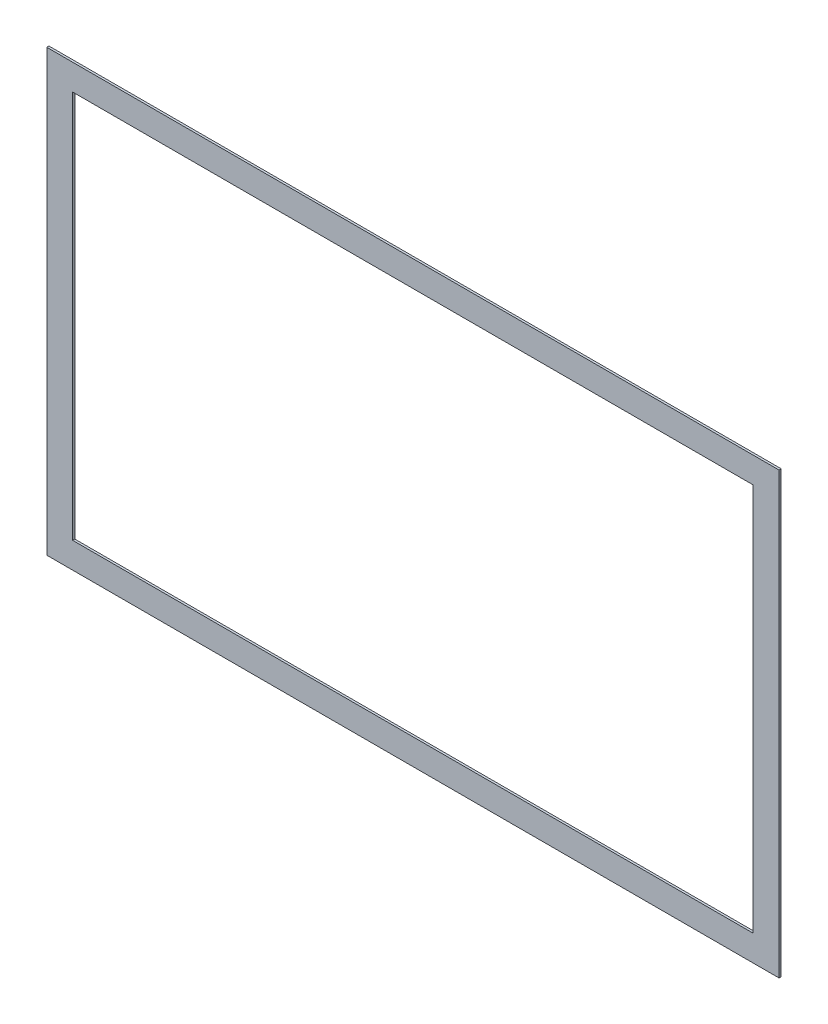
from build123d import *

# Parameters (mm, degrees)
CROQUIS1_W              = 1077
CROQUIS1_H              = 647
CROQUIS1_W_2            = 1001
CROQUIS1_H_2            = 571
SALIENTE_EXTRUIR1_DEPTH = 3.2


with BuildPart() as part:
    # Croquis1 → Saliente-Extruir1 (new body)
    with BuildSketch(Plane.XY):
        with Locations((538.5, 323.5)):
            Rectangle(CROQUIS1_W, CROQUIS1_H)
        with Locations((538.5, 323.5)):
            Rectangle(CROQUIS1_W_2, CROQUIS1_H_2, mode=Mode.SUBTRACT)
    extrude(amount=SALIENTE_EXTRUIR1_DEPTH)


solid = part.part
